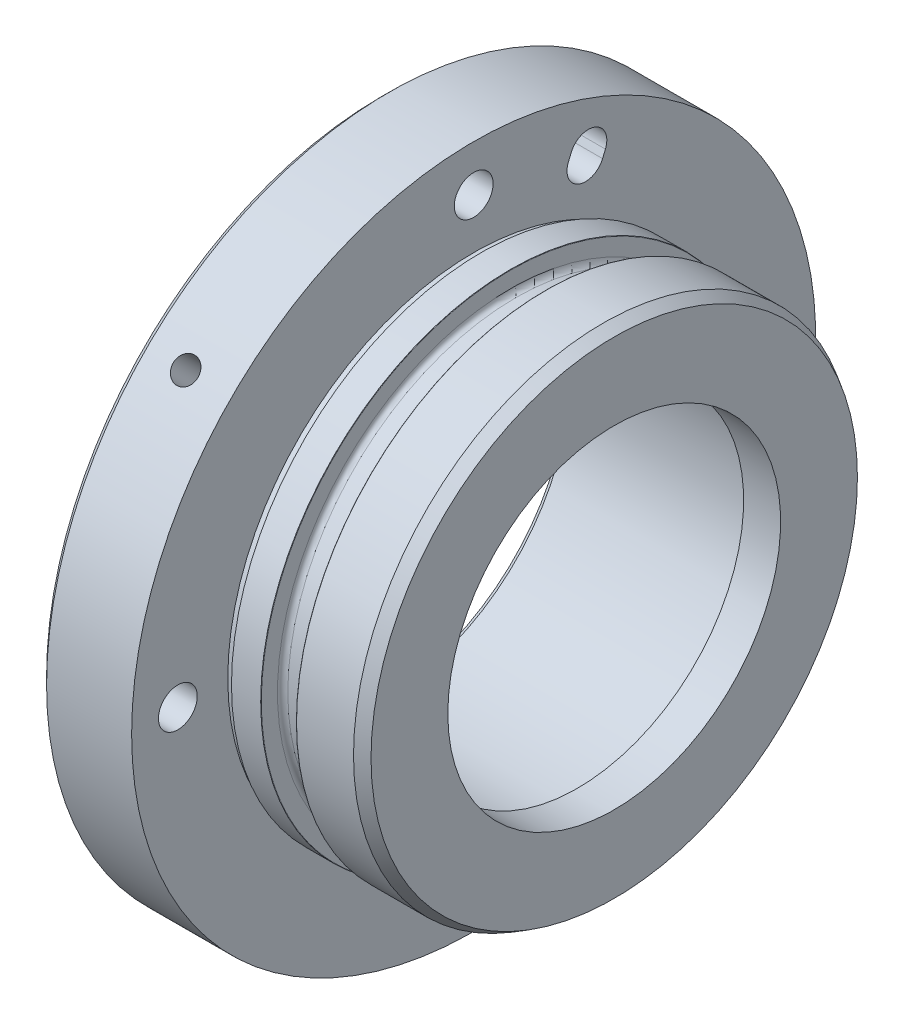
ISO-10303-21;
HEADER;
FILE_DESCRIPTION(('STEP AP214'),'2;1');
FILE_NAME('part.step','',(''),(''),'','','');
FILE_SCHEMA(('AUTOMOTIVE_DESIGN { 1 0 10303 214 1 1 1 1 }'));
ENDSEC;
DATA;
#1=APPLICATION_CONTEXT('core data for automotive mechanical design processes');
#2=APPLICATION_PROTOCOL_DEFINITION('international standard','automotive_design',2000,#1);
#3=PRODUCT_CONTEXT('',#1,'mechanical');
#4=PRODUCT('Part','Part','',(#3));
#5=PRODUCT_RELATED_PRODUCT_CATEGORY('part','',(#4));
#6=PRODUCT_DEFINITION_FORMATION('','',#4);
#7=PRODUCT_DEFINITION_CONTEXT('part definition',#1,'design');
#8=PRODUCT_DEFINITION('design','',#6,#7);
#9=PRODUCT_DEFINITION_SHAPE('','',#8);
#10=(LENGTH_UNIT() NAMED_UNIT(*) SI_UNIT(.MILLI.,.METRE.));
#11=(NAMED_UNIT(*) PLANE_ANGLE_UNIT() SI_UNIT($,.RADIAN.));
#12=(NAMED_UNIT(*) SI_UNIT($,.STERADIAN.) SOLID_ANGLE_UNIT());
#13=UNCERTAINTY_MEASURE_WITH_UNIT(LENGTH_MEASURE(1.E-05),#10,'distance_accuracy_value','');
#14=(GEOMETRIC_REPRESENTATION_CONTEXT(3) GLOBAL_UNCERTAINTY_ASSIGNED_CONTEXT((#13)) GLOBAL_UNIT_ASSIGNED_CONTEXT((#10,
#11,#12)) REPRESENTATION_CONTEXT('',''));
#15=CARTESIAN_POINT('',(0.,0.,0.));
#16=DIRECTION('',(0.,0.,1.));
#17=DIRECTION('',(1.,0.,0.));
#18=AXIS2_PLACEMENT_3D('',#15,#16,#17);
#19=CARTESIAN_POINT('',(-14.2354130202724,0.,0.));
#20=DIRECTION('',(-1.,0.,0.));
#21=DIRECTION('',(0.,0.,1.));
#22=AXIS2_PLACEMENT_3D('',#19,#20,#21);
#23=CYLINDRICAL_SURFACE('',#22,50.);
#24=CARTESIAN_POINT('',(-24.,0.,0.));
#25=DIRECTION('',(1.,0.,0.));
#26=DIRECTION('',(0.,0.,-1.));
#27=AXIS2_PLACEMENT_3D('',#24,#25,#26);
#28=CIRCLE('',#27,50.);
#29=CARTESIAN_POINT('',(-24.,0.,-50.));
#30=VERTEX_POINT('',#29);
#31=EDGE_CURVE('E581',#30,#30,#28,.F.);
#32=ORIENTED_EDGE('',*,*,#31,.T.);
#33=EDGE_LOOP('',(#32));
#34=FACE_BOUND('',#33,.T.);
#35=CARTESIAN_POINT('',(28.,0.,0.));
#36=DIRECTION('',(-1.,0.,0.));
#37=DIRECTION('',(0.,0.,1.));
#38=AXIS2_PLACEMENT_3D('',#35,#36,#37);
#39=CIRCLE('',#38,50.);
#40=CARTESIAN_POINT('',(28.,0.,50.));
#41=VERTEX_POINT('',#40);
#42=EDGE_CURVE('E618',#41,#41,#39,.T.);
#43=ORIENTED_EDGE('',*,*,#42,.F.);
#44=EDGE_LOOP('',(#43));
#45=FACE_BOUND('',#44,.T.);
#46=CARTESIAN_POINT('',(-12.5,32.8882178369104,37.6611886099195));
#47=CARTESIAN_POINT('',(-12.6893433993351,32.8882247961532,37.661183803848));
#48=CARTESIAN_POINT('',(-12.8788185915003,32.9002930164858,37.6506543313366));
#49=CARTESIAN_POINT('',(-13.2525348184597,32.9481979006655,37.6087387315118));
#50=CARTESIAN_POINT('',(-13.4367695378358,32.984062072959,37.5773284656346));
#51=CARTESIAN_POINT('',(-13.7945375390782,33.0783334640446,37.4943699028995));
#52=CARTESIAN_POINT('',(-13.9680765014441,33.1367285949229,37.4428324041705));
#53=CARTESIAN_POINT('',(-14.2995987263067,33.2740955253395,37.3208114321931));
#54=CARTESIAN_POINT('',(-14.4575854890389,33.3530626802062,37.2503322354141));
#55=CARTESIAN_POINT('',(-14.7538365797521,33.5291237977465,37.0919379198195));
#56=CARTESIAN_POINT('',(-14.8920703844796,33.6262452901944,37.0039963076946));
#57=CARTESIAN_POINT('',(-15.1446301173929,33.8354103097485,36.8128379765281));
#58=CARTESIAN_POINT('',(-15.2589550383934,33.9474544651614,36.7096206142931));
#59=CARTESIAN_POINT('',(-15.4605474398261,34.1830403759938,36.4903498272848));
#60=CARTESIAN_POINT('',(-15.5477893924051,34.3065928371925,36.374284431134));
#61=CARTESIAN_POINT('',(-15.6925759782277,34.5612877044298,36.132370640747));
#62=CARTESIAN_POINT('',(-15.7501209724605,34.6924300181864,36.0065223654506));
#63=CARTESIAN_POINT('',(-15.8337947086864,34.9581456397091,35.7485980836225));
#64=CARTESIAN_POINT('',(-15.8599716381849,35.0927133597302,35.6165319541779));
#65=CARTESIAN_POINT('',(-15.8803150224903,35.3615368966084,35.3496474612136));
#66=CARTESIAN_POINT('',(-15.8744818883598,35.4957927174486,35.2148291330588));
#67=CARTESIAN_POINT('',(-15.8310103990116,35.7599760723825,34.946523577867));
#68=CARTESIAN_POINT('',(-15.7934238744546,35.8899103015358,34.8130345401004));
#69=CARTESIAN_POINT('',(-15.6875930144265,36.142148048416,34.5510957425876));
#70=CARTESIAN_POINT('',(-15.6193484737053,36.2644515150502,34.422646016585));
#71=CARTESIAN_POINT('',(-15.4540802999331,36.4983279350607,34.1745691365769));
#72=CARTESIAN_POINT('',(-15.3570332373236,36.609892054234,34.0549492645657));
#73=CARTESIAN_POINT('',(-15.1369318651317,36.8193737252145,33.8283544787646));
#74=CARTESIAN_POINT('',(-15.0138772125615,36.9172910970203,33.7213797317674));
#75=CARTESIAN_POINT('',(-14.7449611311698,37.0972840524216,33.5232681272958));
#76=CARTESIAN_POINT('',(-14.5990547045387,37.1793276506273,33.4321632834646));
#77=CARTESIAN_POINT('',(-14.2887342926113,37.3253885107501,33.2690156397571));
#78=CARTESIAN_POINT('',(-14.1243202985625,37.3894057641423,33.1969728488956));
#79=CARTESIAN_POINT('',(-13.7816224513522,37.4979340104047,33.0743357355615));
#80=CARTESIAN_POINT('',(-13.603337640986,37.5424436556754,33.0237428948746));
#81=CARTESIAN_POINT('',(-13.2379726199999,37.6109297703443,32.9457232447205));
#82=CARTESIAN_POINT('',(-13.0508925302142,37.6349065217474,32.9182961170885));
#83=CARTESIAN_POINT('',(-12.6736424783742,37.6617552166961,32.8875754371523));
#84=CARTESIAN_POINT('',(-12.4834793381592,37.6646686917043,32.8842343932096));
#85=CARTESIAN_POINT('',(-12.1051140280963,37.6494347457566,32.9016746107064));
#86=CARTESIAN_POINT('',(-11.9169118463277,37.631287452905,32.9224557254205));
#87=CARTESIAN_POINT('',(-11.5479894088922,37.5743703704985,32.9873996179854));
#88=CARTESIAN_POINT('',(-11.3672623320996,37.5356198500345,33.0315405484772));
#89=CARTESIAN_POINT('',(-11.0182095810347,37.4383888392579,33.1417019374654));
#90=CARTESIAN_POINT('',(-10.8498840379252,37.3799081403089,33.2077226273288));
#91=CARTESIAN_POINT('',(-10.5301235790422,37.2444527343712,33.3595723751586));
#92=CARTESIAN_POINT('',(-10.3787154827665,37.1674492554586,33.4454322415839));
#93=CARTESIAN_POINT('',(-10.097358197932,36.9968005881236,33.634102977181));
#94=CARTESIAN_POINT('',(-9.96740925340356,36.9031552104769,33.7369140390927));
#95=CARTESIAN_POINT('',(-9.73244593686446,36.7013116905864,33.956382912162));
#96=CARTESIAN_POINT('',(-9.62747233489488,36.5930901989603,34.0730629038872));
#97=CARTESIAN_POINT('',(-9.44571866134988,36.3649158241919,34.3164783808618));
#98=CARTESIAN_POINT('',(-9.36893839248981,36.2449630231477,34.4432137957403));
#99=CARTESIAN_POINT('',(-9.24582162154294,35.9965478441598,34.7027485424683));
#100=CARTESIAN_POINT('',(-9.199459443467,35.8680927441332,34.8355426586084));
#101=CARTESIAN_POINT('',(-9.13841090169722,35.6060540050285,35.1033331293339));
#102=CARTESIAN_POINT('',(-9.12372416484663,35.4724704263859,35.2383294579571));
#103=CARTESIAN_POINT('',(-9.12644715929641,35.2041922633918,35.5063477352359));
#104=CARTESIAN_POINT('',(-9.14379314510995,35.0695004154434,35.6393730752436));
#105=CARTESIAN_POINT('',(-9.20995686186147,34.8026387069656,35.900015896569));
#106=CARTESIAN_POINT('',(-9.25877464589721,34.6704688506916,36.0276333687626));
#107=CARTESIAN_POINT('',(-9.38648137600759,34.4125881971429,36.2740348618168));
#108=CARTESIAN_POINT('',(-9.46536984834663,34.2868772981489,36.3928190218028));
#109=CARTESIAN_POINT('',(-9.65097023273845,34.0457512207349,36.6184943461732));
#110=CARTESIAN_POINT('',(-9.75768148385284,33.9303357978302,36.7253857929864));
#111=CARTESIAN_POINT('',(-9.99613525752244,33.7131956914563,36.9248188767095));
#112=CARTESIAN_POINT('',(-10.1279242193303,33.6114970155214,37.0173333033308));
#113=CARTESIAN_POINT('',(-10.4127232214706,33.4252794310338,37.1855682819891));
#114=CARTESIAN_POINT('',(-10.5657384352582,33.3407647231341,37.26128472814));
#115=CARTESIAN_POINT('',(-10.8888469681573,33.1916110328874,37.3942105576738));
#116=CARTESIAN_POINT('',(-11.0589634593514,33.1269995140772,37.4513943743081));
#117=CARTESIAN_POINT('',(-11.4111551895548,33.0200297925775,37.5457423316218));
#118=CARTESIAN_POINT('',(-11.5932161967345,32.9776456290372,37.5829298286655));
#119=CARTESIAN_POINT('',(-11.8969856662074,32.9275289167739,37.6268317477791));
#120=CARTESIAN_POINT('',(-12.0167325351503,32.9128094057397,37.6397017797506));
#121=CARTESIAN_POINT('',(-12.2576349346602,32.8931516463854,37.6568817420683));
#122=CARTESIAN_POINT('',(-12.3787904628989,32.8882133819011,37.6611916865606));
#123=CARTESIAN_POINT('',(-12.5,32.8882178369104,37.6611886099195));
#124=B_SPLINE_CURVE_WITH_KNOTS('',3,(#46,#47,#48,#49,#50,#51,#52,#53,#54,#55,#56,#57,#58,#59,
#60,#61,#62,#63,#64,#65,#66,#67,#68,#69,#70,#71,#72,#73,#74,#75,#76,#77,#78,#79,#80,#81,#82,#83,
#84,#85,#86,#87,#88,#89,#90,#91,#92,#93,#94,#95,#96,#97,#98,#99,#100,#101,#102,#103,#104,#105,
#106,#107,#108,#109,#110,#111,#112,#113,#114,#115,#116,#117,#118,#119,#120,#121,#122,#123),
.UNSPECIFIED.,.T.,.F.,(4,2,2,2,2,2,2,2,2,2,2,2,2,2,2,2,2,2,2,2,2,2,2,2,2,2,2,2,2,2,2,2,2,2,2,2,
2,2,4),(0.,0.567587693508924,1.13583267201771,1.70377320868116,2.27158562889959,2.8402661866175,
3.40897069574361,3.97820963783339,4.54744166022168,5.11579810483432,5.68414725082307,
6.25157047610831,6.81899750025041,7.38688737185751,7.95478473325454,8.52381474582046,
9.09284502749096,9.66191461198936,10.2309763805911,10.7989157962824,11.3668517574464,
11.9342574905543,12.5016692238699,13.0699680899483,13.6382734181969,14.2075001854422,
14.7767229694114,15.3454646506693,15.9141996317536,16.4818040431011,17.0494094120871,
17.6170058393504,18.1845887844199,18.7532332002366,19.3220164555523,19.8915810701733,
20.460478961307,20.8238249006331,21.1871702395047),.UNSPECIFIED.);
#125=CARTESIAN_POINT('',(-12.5,32.8882178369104,37.6611886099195));
#126=VERTEX_POINT('',#125);
#127=EDGE_CURVE('E552',#126,#126,#124,.T.);
#128=ORIENTED_EDGE('',*,*,#127,.F.);
#129=EDGE_LOOP('',(#128));
#130=FACE_BOUND('',#129,.T.);
#131=ADVANCED_FACE('F458',(#34,#45,#130),#23,.F.);
#132=CARTESIAN_POINT('',(-14.2354130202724,0.,0.));
#133=DIRECTION('',(-1.,0.,0.));
#134=DIRECTION('',(0.,0.,1.));
#135=AXIS2_PLACEMENT_3D('',#132,#133,#134);
#136=CYLINDRICAL_SURFACE('',#135,92.5);
#137=CARTESIAN_POINT('',(-23.,0.,0.));
#138=DIRECTION('',(1.,0.,0.));
#139=DIRECTION('',(0.,0.,-1.));
#140=AXIS2_PLACEMENT_3D('',#137,#138,#139);
#141=CIRCLE('',#140,92.5);
#142=CARTESIAN_POINT('',(-23.,0.,-92.5));
#143=VERTEX_POINT('',#142);
#144=EDGE_CURVE('E582',#143,#143,#141,.T.);
#145=ORIENTED_EDGE('',*,*,#144,.T.);
#146=EDGE_LOOP('',(#145));
#147=FACE_BOUND('',#146,.T.);
#148=CARTESIAN_POINT('',(0.,0.,0.));
#149=DIRECTION('',(-1.,0.,0.));
#150=DIRECTION('',(0.,0.,1.));
#151=AXIS2_PLACEMENT_3D('',#148,#149,#150);
#152=CIRCLE('',#151,92.5);
#153=CARTESIAN_POINT('',(0.,0.,92.5));
#154=VERTEX_POINT('',#153);
#155=EDGE_CURVE('E645',#154,#154,#152,.T.);
#156=ORIENTED_EDGE('',*,*,#155,.T.);
#157=EDGE_LOOP('',(#156));
#158=FACE_BOUND('',#157,.T.);
#159=CARTESIAN_POINT('',(-12.5,62.9773401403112,67.7503109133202));
#160=CARTESIAN_POINT('',(-12.3104924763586,62.9773466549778,67.750305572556));
#161=CARTESIAN_POINT('',(-12.1208491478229,62.9890809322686,67.739403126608));
#162=CARTESIAN_POINT('',(-11.7467900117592,63.0356923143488,67.6960299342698));
#163=CARTESIAN_POINT('',(-11.5623806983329,63.070596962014,67.6635335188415));
#164=CARTESIAN_POINT('',(-11.2042626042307,63.1624489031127,67.5777994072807));
#165=CARTESIAN_POINT('',(-11.0305485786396,63.2193852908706,67.5245719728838));
#166=CARTESIAN_POINT('',(-10.6987108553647,63.3535122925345,67.3987454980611));
#167=CARTESIAN_POINT('',(-10.5405833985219,63.4306980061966,67.3261511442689));
#168=CARTESIAN_POINT('',(-10.2442634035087,63.6029927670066,67.1634075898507));
#169=CARTESIAN_POINT('',(-10.1060812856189,63.6981111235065,67.07324927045));
#170=CARTESIAN_POINT('',(-9.85366263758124,63.9033439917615,66.8777442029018));
#171=CARTESIAN_POINT('',(-9.73942706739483,64.0134591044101,66.7723968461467));
#172=CARTESIAN_POINT('',(-9.5381224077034,64.2453916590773,66.549271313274));
#173=CARTESIAN_POINT('',(-9.45106040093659,64.3672121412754,66.4314899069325));
#174=CARTESIAN_POINT('',(-9.30662000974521,64.6189040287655,66.186690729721));
#175=CARTESIAN_POINT('',(-9.24924147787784,64.7487753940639,66.0596730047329));
#176=CARTESIAN_POINT('',(-9.16582149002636,65.0127004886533,65.7999469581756));
#177=CARTESIAN_POINT('',(-9.13976597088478,65.1467523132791,65.6672412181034));
#178=CARTESIAN_POINT('',(-9.1196882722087,65.4152283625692,65.3997996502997));
#179=CARTESIAN_POINT('',(-9.12566593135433,65.5496525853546,65.2650638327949));
#180=CARTESIAN_POINT('',(-9.16947312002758,65.8150037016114,64.9974675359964));
#181=CARTESIAN_POINT('',(-9.20728748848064,65.9459322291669,64.8646061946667));
#182=CARTESIAN_POINT('',(-9.31367121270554,66.2007255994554,64.6045438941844));
#183=CARTESIAN_POINT('',(-9.3822406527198,66.324590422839,64.4773429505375));
#184=CARTESIAN_POINT('',(-9.54820545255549,66.5619147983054,64.2323176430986));
#185=CARTESIAN_POINT('',(-9.64560774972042,66.6753718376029,64.1144955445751));
#186=CARTESIAN_POINT('',(-9.86646825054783,66.8888178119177,63.8917825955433));
#187=CARTESIAN_POINT('',(-9.98992654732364,66.9888066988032,63.7868917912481));
#188=CARTESIAN_POINT('',(-10.2594803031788,67.1727454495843,63.5931612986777));
#189=CARTESIAN_POINT('',(-10.4055889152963,67.2566859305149,63.5043310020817));
#190=CARTESIAN_POINT('',(-10.7162494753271,67.4062804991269,63.3455230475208));
#191=CARTESIAN_POINT('',(-10.8808014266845,67.4719345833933,63.2755453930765));
#192=CARTESIAN_POINT('',(-11.2236852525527,67.5832742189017,63.1566126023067));
#193=CARTESIAN_POINT('',(-11.4020173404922,67.6289594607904,63.1076577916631));
#194=CARTESIAN_POINT('',(-11.7673957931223,67.6991967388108,63.0323047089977));
#195=CARTESIAN_POINT('',(-11.9544421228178,67.723748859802,63.0059063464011));
#196=CARTESIAN_POINT('',(-12.3318239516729,67.7510898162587,62.9765054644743));
#197=CARTESIAN_POINT('',(-12.5221574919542,67.753891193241,62.9734894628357));
#198=CARTESIAN_POINT('',(-12.9008123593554,67.7376928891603,62.9909128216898));
#199=CARTESIAN_POINT('',(-13.0891336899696,67.7186932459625,63.0113521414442));
#200=CARTESIAN_POINT('',(-13.4583669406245,67.6593818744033,63.0750340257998));
#201=CARTESIAN_POINT('',(-13.6392808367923,67.6190758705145,63.1182704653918));
#202=CARTESIAN_POINT('',(-13.9886244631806,67.518178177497,63.2261895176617));
#203=CARTESIAN_POINT('',(-14.1570541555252,67.4575864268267,63.2908721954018));
#204=CARTESIAN_POINT('',(-14.4767330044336,67.3176323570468,63.4397097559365));
#205=CARTESIAN_POINT('',(-14.6279742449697,67.2382614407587,63.5238735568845));
#206=CARTESIAN_POINT('',(-14.9089034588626,67.0628122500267,63.7090687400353));
#207=CARTESIAN_POINT('',(-15.0385913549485,66.9667339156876,63.8101001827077));
#208=CARTESIAN_POINT('',(-15.2727940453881,66.7603339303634,64.0260110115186));
#209=CARTESIAN_POINT('',(-15.3772969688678,66.6500056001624,64.1408968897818));
#210=CARTESIAN_POINT('',(-15.5580821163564,66.4180774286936,64.3810283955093));
#211=CARTESIAN_POINT('',(-15.6343644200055,66.2964776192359,64.5062739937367));
#212=CARTESIAN_POINT('',(-15.7565221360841,66.0453356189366,64.7633839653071));
#213=CARTESIAN_POINT('',(-15.802405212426,65.9157954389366,64.8952466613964));
#214=CARTESIAN_POINT('',(-15.8624871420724,65.652326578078,65.1617764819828));
#215=CARTESIAN_POINT('',(-15.8766860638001,65.5183979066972,65.2964436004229));
#216=CARTESIAN_POINT('',(-15.8729957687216,65.2500063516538,65.5646447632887));
#217=CARTESIAN_POINT('',(-15.8551252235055,65.1155438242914,65.6981794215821));
#218=CARTESIAN_POINT('',(-15.7878417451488,64.8498632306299,65.9604434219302));
#219=CARTESIAN_POINT('',(-15.7384287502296,64.7186451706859,66.0891727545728));
#220=CARTESIAN_POINT('',(-15.6094661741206,64.4632790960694,66.3382807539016));
#221=CARTESIAN_POINT('',(-15.5299161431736,64.3391311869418,66.4586592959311));
#222=CARTESIAN_POINT('',(-15.3429424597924,64.101587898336,66.687807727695));
#223=CARTESIAN_POINT('',(-15.2355197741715,63.9881921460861,66.7965780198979));
#224=CARTESIAN_POINT('',(-14.9957891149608,63.7755021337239,66.9996791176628));
#225=CARTESIAN_POINT('',(-14.8634693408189,63.6762145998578,67.0940030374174));
#226=CARTESIAN_POINT('',(-14.5776856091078,63.4948046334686,67.2657076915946));
#227=CARTESIAN_POINT('',(-14.4242164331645,63.4126864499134,67.3430842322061));
#228=CARTESIAN_POINT('',(-14.1004140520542,63.2681253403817,67.4789166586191));
#229=CARTESIAN_POINT('',(-13.930068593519,63.2056968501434,67.5373586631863));
#230=CARTESIAN_POINT('',(-13.5775661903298,63.1025985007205,67.6336978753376));
#231=CARTESIAN_POINT('',(-13.3954235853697,63.0619027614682,67.671619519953));
#232=CARTESIAN_POINT('',(-13.0934461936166,63.0143005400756,67.7159398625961));
#233=CARTESIAN_POINT('',(-12.9755704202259,63.0004594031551,67.7288142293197));
#234=CARTESIAN_POINT('',(-12.7384810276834,62.9819771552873,67.7460014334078));
#235=CARTESIAN_POINT('',(-12.6192674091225,62.9773360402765,67.750314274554));
#236=CARTESIAN_POINT('',(-12.5,62.9773401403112,67.7503109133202));
#237=B_SPLINE_CURVE_WITH_KNOTS('',3,(#159,#160,#161,#162,#163,#164,#165,#166,#167,#168,#169,
#170,#171,#172,#173,#174,#175,#176,#177,#178,#179,#180,#181,#182,#183,#184,#185,#186,#187,#188,
#189,#190,#191,#192,#193,#194,#195,#196,#197,#198,#199,#200,#201,#202,#203,#204,#205,#206,#207,
#208,#209,#210,#211,#212,#213,#214,#215,#216,#217,#218,#219,#220,#221,#222,#223,#224,#225,#226,
#227,#228,#229,#230,#231,#232,#233,#234,#235,#236),.UNSPECIFIED.,.T.,.F.,(4,2,2,2,2,2,2,2,2,2,2,
2,2,2,2,2,2,2,2,2,2,2,2,2,2,2,2,2,2,2,2,2,2,2,2,2,2,2,4),(0.,0.568087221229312,1.13685094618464,
1.70533349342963,2.27367859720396,2.84231956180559,3.41098331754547,3.97979517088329,
4.54860419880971,5.11715775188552,5.68570844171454,6.25398853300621,6.82227018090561,
7.39068867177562,7.9591091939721,8.52786104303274,9.0966129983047,9.66537376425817,
10.2341322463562,10.8025627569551,11.3709922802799,11.9392691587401,12.5075477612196,
13.0760870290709,13.6446283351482,14.2134370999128,14.7822442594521,15.3509079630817,
15.9195704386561,16.4879019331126,17.0562345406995,17.6245756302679,18.1928970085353,
18.7614884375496,19.3302204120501,19.8993683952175,20.4678370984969,20.8253654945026,
21.1828937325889),.UNSPECIFIED.);
#238=CARTESIAN_POINT('',(-12.5,62.9773401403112,67.7503109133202));
#239=VERTEX_POINT('',#238);
#240=EDGE_CURVE('E574',#239,#239,#237,.T.);
#241=ORIENTED_EDGE('',*,*,#240,.F.);
#242=EDGE_LOOP('',(#241));
#243=FACE_BOUND('',#242,.T.);
#244=ADVANCED_FACE('F586',(#147,#158,#243),#136,.T.);
#245=CARTESIAN_POINT('',(-14.2354130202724,0.,0.));
#246=DIRECTION('',(-1.,0.,0.));
#247=DIRECTION('',(0.,0.,1.));
#248=AXIS2_PLACEMENT_3D('',#245,#246,#247);
#249=CYLINDRICAL_SURFACE('',#248,67.5);
#250=CARTESIAN_POINT('',(19.6,0.,0.));
#251=DIRECTION('',(-1.,0.,0.));
#252=DIRECTION('',(0.,0.,1.));
#253=AXIS2_PLACEMENT_3D('',#250,#251,#252);
#254=CIRCLE('',#253,67.5);
#255=CARTESIAN_POINT('',(19.6,0.,67.5));
#256=VERTEX_POINT('',#255);
#257=EDGE_CURVE('E1011',#256,#256,#254,.F.);
#258=ORIENTED_EDGE('',*,*,#257,.T.);
#259=EDGE_LOOP('',(#258));
#260=FACE_BOUND('',#259,.T.);
#261=CARTESIAN_POINT('',(35.,0.,0.));
#262=DIRECTION('',(-1.,0.,0.));
#263=DIRECTION('',(0.,0.,1.));
#264=AXIS2_PLACEMENT_3D('',#261,#262,#263);
#265=CIRCLE('',#264,67.5);
#266=CARTESIAN_POINT('',(35.,0.,67.5));
#267=VERTEX_POINT('',#266);
#268=EDGE_CURVE('E648',#267,#267,#265,.T.);
#269=ORIENTED_EDGE('',*,*,#268,.T.);
#270=EDGE_LOOP('',(#269));
#271=FACE_BOUND('',#270,.T.);
#272=ADVANCED_FACE('F590',(#260,#271),#249,.T.);
#273=CARTESIAN_POINT('',(9.9,0.,0.));
#274=DIRECTION('',(1.,0.,0.));
#275=DIRECTION('',(0.,0.,-1.));
#276=AXIS2_PLACEMENT_3D('',#273,#274,#275);
#277=CIRCLE('',#276,67.5);
#278=CARTESIAN_POINT('',(9.9,0.,-67.5));
#279=VERTEX_POINT('',#278);
#280=EDGE_CURVE('E1008',#279,#279,#277,.F.);
#281=ORIENTED_EDGE('',*,*,#280,.T.);
#282=EDGE_LOOP('',(#281));
#283=FACE_BOUND('',#282,.T.);
#284=CARTESIAN_POINT('',(2.,0.,0.));
#285=DIRECTION('',(-1.,0.,0.));
#286=DIRECTION('',(0.,0.,1.));
#287=AXIS2_PLACEMENT_3D('',#284,#285,#286);
#288=CIRCLE('',#287,67.5);
#289=CARTESIAN_POINT('',(2.,0.,67.5));
#290=VERTEX_POINT('',#289);
#291=EDGE_CURVE('E636',#290,#290,#288,.T.);
#292=ORIENTED_EDGE('',*,*,#291,.F.);
#293=EDGE_LOOP('',(#292));
#294=FACE_BOUND('',#293,.T.);
#295=ADVANCED_FACE('F595',(#283,#294),#249,.T.);
#296=CARTESIAN_POINT('',(-25.,92.5,0.));
#297=DIRECTION('',(1.,0.,0.));
#298=DIRECTION('',(0.,0.,-1.));
#299=AXIS2_PLACEMENT_3D('',#296,#297,#298);
#300=PLANE('',#299);
#301=CARTESIAN_POINT('',(-25.,0.,0.));
#302=DIRECTION('',(1.,0.,0.));
#303=DIRECTION('',(0.,0.,-1.));
#304=AXIS2_PLACEMENT_3D('',#301,#302,#303);
#305=CIRCLE('',#304,50.5773502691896);
#306=CARTESIAN_POINT('',(-25.,0.,-50.5773502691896));
#307=VERTEX_POINT('',#306);
#308=EDGE_CURVE('E1016',#307,#307,#305,.T.);
#309=ORIENTED_EDGE('',*,*,#308,.T.);
#310=EDGE_LOOP('',(#309));
#311=FACE_BOUND('',#310,.T.);
#312=CARTESIAN_POINT('',(-25.,28.7500000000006,-49.7964607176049));
#313=DIRECTION('',(-1.,0.,0.));
#314=DIRECTION('',(0.,0.,1.));
#315=AXIS2_PLACEMENT_3D('',#312,#313,#314);
#316=CIRCLE('',#315,3.4);
#317=CARTESIAN_POINT('',(-25.,28.7500000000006,-46.3964607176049));
#318=VERTEX_POINT('',#317);
#319=EDGE_CURVE('E1045',#318,#318,#316,.T.);
#320=ORIENTED_EDGE('',*,*,#319,.F.);
#321=EDGE_LOOP('',(#320));
#322=FACE_BOUND('',#321,.T.);
#323=CARTESIAN_POINT('',(-25.,-28.7499999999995,-49.7964607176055));
#324=DIRECTION('',(-1.,0.,0.));
#325=DIRECTION('',(0.,0.,1.));
#326=AXIS2_PLACEMENT_3D('',#323,#324,#325);
#327=CIRCLE('',#326,3.4);
#328=CARTESIAN_POINT('',(-25.,-28.7499999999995,-46.3964607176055));
#329=VERTEX_POINT('',#328);
#330=EDGE_CURVE('E1051',#329,#329,#327,.T.);
#331=ORIENTED_EDGE('',*,*,#330,.F.);
#332=EDGE_LOOP('',(#331));
#333=FACE_BOUND('',#332,.T.);
#334=CARTESIAN_POINT('',(-25.,-57.5,-4.01520586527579E-13));
#335=DIRECTION('',(-1.,0.,0.));
#336=DIRECTION('',(0.,0.,1.));
#337=AXIS2_PLACEMENT_3D('',#334,#335,#336);
#338=CIRCLE('',#337,3.39999999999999);
#339=CARTESIAN_POINT('',(-25.,-57.5,3.39999999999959));
#340=VERTEX_POINT('',#339);
#341=EDGE_CURVE('E1059',#340,#340,#338,.T.);
#342=ORIENTED_EDGE('',*,*,#341,.F.);
#343=EDGE_LOOP('',(#342));
#344=FACE_BOUND('',#343,.T.);
#345=CARTESIAN_POINT('',(-25.,-28.7500000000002,49.7964607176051));
#346=DIRECTION('',(-1.,0.,0.));
#347=DIRECTION('',(0.,0.,1.));
#348=AXIS2_PLACEMENT_3D('',#345,#346,#347);
#349=CIRCLE('',#348,3.4);
#350=CARTESIAN_POINT('',(-25.,-28.7500000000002,53.1964607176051));
#351=VERTEX_POINT('',#350);
#352=EDGE_CURVE('E1065',#351,#351,#349,.T.);
#353=ORIENTED_EDGE('',*,*,#352,.F.);
#354=EDGE_LOOP('',(#353));
#355=FACE_BOUND('',#354,.T.);
#356=CARTESIAN_POINT('',(-25.,28.7499999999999,49.7964607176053));
#357=DIRECTION('',(-1.,0.,0.));
#358=DIRECTION('',(0.,0.,1.));
#359=AXIS2_PLACEMENT_3D('',#356,#357,#358);
#360=CIRCLE('',#359,3.4);
#361=CARTESIAN_POINT('',(-25.,28.7499999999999,53.1964607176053));
#362=VERTEX_POINT('',#361);
#363=EDGE_CURVE('E1070',#362,#362,#360,.T.);
#364=ORIENTED_EDGE('',*,*,#363,.F.);
#365=EDGE_LOOP('',(#364));
#366=FACE_BOUND('',#365,.T.);
#367=CARTESIAN_POINT('',(-25.,8.37956006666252E-13,-80.));
#368=DIRECTION('',(-1.,0.,0.));
#369=DIRECTION('',(0.,0.,1.));
#370=AXIS2_PLACEMENT_3D('',#367,#368,#369);
#371=CIRCLE('',#370,5.24999999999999);
#372=CARTESIAN_POINT('',(-25.,8.37956006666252E-13,-74.75));
#373=VERTEX_POINT('',#372);
#374=EDGE_CURVE('E675',#373,#373,#371,.T.);
#375=ORIENTED_EDGE('',*,*,#374,.F.);
#376=EDGE_LOOP('',(#375));
#377=FACE_BOUND('',#376,.T.);
#378=CARTESIAN_POINT('',(-25.,-80.,-5.58637337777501E-13));
#379=DIRECTION('',(-1.,0.,0.));
#380=DIRECTION('',(0.,0.,1.));
#381=AXIS2_PLACEMENT_3D('',#378,#379,#380);
#382=CIRCLE('',#381,5.24999999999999);
#383=CARTESIAN_POINT('',(-25.,-80.,5.24999999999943));
#384=VERTEX_POINT('',#383);
#385=EDGE_CURVE('E665',#384,#384,#382,.T.);
#386=ORIENTED_EDGE('',*,*,#385,.F.);
#387=EDGE_LOOP('',(#386));
#388=FACE_BOUND('',#387,.T.);
#389=CARTESIAN_POINT('',(-25.,-2.79318668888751E-13,80.));
#390=DIRECTION('',(-1.,0.,0.));
#391=DIRECTION('',(0.,0.,1.));
#392=AXIS2_PLACEMENT_3D('',#389,#390,#391);
#393=CIRCLE('',#392,5.24999999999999);
#394=CARTESIAN_POINT('',(-25.,-2.79318668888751E-13,85.25));
#395=VERTEX_POINT('',#394);
#396=EDGE_CURVE('E662',#395,#395,#393,.T.);
#397=ORIENTED_EDGE('',*,*,#396,.F.);
#398=EDGE_LOOP('',(#397));
#399=FACE_BOUND('',#398,.T.);
#400=CARTESIAN_POINT('',(-25.,57.5,0.));
#401=DIRECTION('',(-1.,0.,0.));
#402=DIRECTION('',(0.,0.,1.));
#403=AXIS2_PLACEMENT_3D('',#400,#401,#402);
#404=CIRCLE('',#403,3.39999999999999);
#405=CARTESIAN_POINT('',(-25.,57.5,3.39999999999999));
#406=VERTEX_POINT('',#405);
#407=EDGE_CURVE('E680',#406,#406,#404,.T.);
#408=ORIENTED_EDGE('',*,*,#407,.F.);
#409=EDGE_LOOP('',(#408));
#410=FACE_BOUND('',#409,.T.);
#411=CARTESIAN_POINT('',(-25.,80.,0.));
#412=DIRECTION('',(-1.,0.,0.));
#413=DIRECTION('',(0.,0.,1.));
#414=AXIS2_PLACEMENT_3D('',#411,#412,#413);
#415=CIRCLE('',#414,5.24999999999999);
#416=CARTESIAN_POINT('',(-25.,80.,5.24999999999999));
#417=VERTEX_POINT('',#416);
#418=EDGE_CURVE('E629',#417,#417,#415,.T.);
#419=ORIENTED_EDGE('',*,*,#418,.F.);
#420=EDGE_LOOP('',(#419));
#421=FACE_BOUND('',#420,.T.);
#422=CARTESIAN_POINT('',(-25.,0.,0.));
#423=DIRECTION('',(1.,0.,0.));
#424=DIRECTION('',(0.,0.,-1.));
#425=AXIS2_PLACEMENT_3D('',#422,#423,#424);
#426=CIRCLE('',#425,90.5);
#427=CARTESIAN_POINT('',(-25.,0.,-90.5));
#428=VERTEX_POINT('',#427);
#429=EDGE_CURVE('E654',#428,#428,#426,.F.);
#430=ORIENTED_EDGE('',*,*,#429,.T.);
#431=EDGE_LOOP('',(#430));
#432=FACE_BOUND('',#431,.T.);
#433=ADVANCED_FACE('F593',(#311,#322,#333,#344,#355,#366,#377,#388,#399,#410,#421,#432),#300,.F.);
#434=CARTESIAN_POINT('',(0.,66.5,0.));
#435=DIRECTION('',(-1.,0.,0.));
#436=DIRECTION('',(0.,0.,1.));
#437=AXIS2_PLACEMENT_3D('',#434,#435,#436);
#438=PLANE('',#437);
#439=DIRECTION('',(0.,0.923879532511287,-0.38268343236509));
#440=VECTOR('',#439,1.);
#441=CARTESIAN_POINT('',(0.,71.0730659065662,-34.8513888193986));
#442=LINE('',#441,#440);
#443=CARTESIAN_POINT('',(0.,71.0730659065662,-34.8513888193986));
#444=VERTEX_POINT('',#443);
#445=CARTESIAN_POINT('',(0.,72.9208249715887,-35.6167556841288));
#446=VERTEX_POINT('',#445);
#447=EDGE_CURVE('E529',#444,#446,#442,.T.);
#448=ORIENTED_EDGE('',*,*,#447,.F.);
#449=CARTESIAN_POINT('',(0.,72.9864830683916,-30.2319911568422));
#450=DIRECTION('',(1.,0.,0.));
#451=DIRECTION('',(0.,0.,-1.));
#452=AXIS2_PLACEMENT_3D('',#449,#450,#451);
#453=CIRCLE('',#452,5.00000000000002);
#454=CARTESIAN_POINT('',(0.,74.8999002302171,-25.6125934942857));
#455=VERTEX_POINT('',#454);
#456=EDGE_CURVE('E473',#455,#444,#453,.T.);
#457=ORIENTED_EDGE('',*,*,#456,.F.);
#458=DIRECTION('',(0.,-0.923879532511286,0.382683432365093));
#459=VECTOR('',#458,1.);
#460=CARTESIAN_POINT('',(0.,74.8999002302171,-25.6125934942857));
#461=LINE('',#460,#459);
#462=CARTESIAN_POINT('',(0.,76.7476592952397,-26.3779603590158));
#463=VERTEX_POINT('',#462);
#464=EDGE_CURVE('E536',#463,#455,#461,.T.);
#465=ORIENTED_EDGE('',*,*,#464,.F.);
#466=CARTESIAN_POINT('',(0.,74.8342421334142,-30.9973580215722));
#467=DIRECTION('',(1.,0.,0.));
#468=DIRECTION('',(0.,0.,1.));
#469=AXIS2_PLACEMENT_3D('',#466,#467,#468);
#470=CIRCLE('',#469,5.00000000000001);
#471=EDGE_CURVE('E518',#446,#463,#470,.T.);
#472=ORIENTED_EDGE('',*,*,#471,.F.);
#473=EDGE_LOOP('',(#448,#457,#465,#472));
#474=FACE_BOUND('',#473,.T.);
#475=CARTESIAN_POINT('',(0.,8.37956006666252E-13,-80.));
#476=DIRECTION('',(-1.,0.,0.));
#477=DIRECTION('',(0.,0.,1.));
#478=AXIS2_PLACEMENT_3D('',#475,#476,#477);
#479=CIRCLE('',#478,5.24999999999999);
#480=CARTESIAN_POINT('',(0.,8.37956006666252E-13,-74.75));
#481=VERTEX_POINT('',#480);
#482=EDGE_CURVE('E583',#481,#481,#479,.T.);
#483=ORIENTED_EDGE('',*,*,#482,.T.);
#484=EDGE_LOOP('',(#483));
#485=FACE_BOUND('',#484,.T.);
#486=CARTESIAN_POINT('',(0.,-80.,-5.58637337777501E-13));
#487=DIRECTION('',(-1.,0.,0.));
#488=DIRECTION('',(0.,0.,1.));
#489=AXIS2_PLACEMENT_3D('',#486,#487,#488);
#490=CIRCLE('',#489,5.24999999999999);
#491=CARTESIAN_POINT('',(0.,-80.,5.24999999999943));
#492=VERTEX_POINT('',#491);
#493=EDGE_CURVE('E663',#492,#492,#490,.T.);
#494=ORIENTED_EDGE('',*,*,#493,.T.);
#495=EDGE_LOOP('',(#494));
#496=FACE_BOUND('',#495,.T.);
#497=CARTESIAN_POINT('',(0.,-2.79318668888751E-13,80.));
#498=DIRECTION('',(-1.,0.,0.));
#499=DIRECTION('',(0.,0.,1.));
#500=AXIS2_PLACEMENT_3D('',#497,#498,#499);
#501=CIRCLE('',#500,5.24999999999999);
#502=CARTESIAN_POINT('',(0.,-2.79318668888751E-13,85.25));
#503=VERTEX_POINT('',#502);
#504=EDGE_CURVE('E659',#503,#503,#501,.T.);
#505=ORIENTED_EDGE('',*,*,#504,.T.);
#506=EDGE_LOOP('',(#505));
#507=FACE_BOUND('',#506,.T.);
#508=CARTESIAN_POINT('',(0.,80.,0.));
#509=DIRECTION('',(-1.,0.,0.));
#510=DIRECTION('',(0.,0.,1.));
#511=AXIS2_PLACEMENT_3D('',#508,#509,#510);
#512=CIRCLE('',#511,5.24999999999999);
#513=CARTESIAN_POINT('',(0.,80.,5.24999999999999));
#514=VERTEX_POINT('',#513);
#515=EDGE_CURVE('E623',#514,#514,#512,.T.);
#516=ORIENTED_EDGE('',*,*,#515,.T.);
#517=EDGE_LOOP('',(#516));
#518=FACE_BOUND('',#517,.T.);
#519=ORIENTED_EDGE('',*,*,#155,.F.);
#520=EDGE_LOOP('',(#519));
#521=FACE_BOUND('',#520,.T.);
#522=CARTESIAN_POINT('',(0.,0.,0.));
#523=DIRECTION('',(-1.,0.,0.));
#524=DIRECTION('',(0.,0.,1.));
#525=AXIS2_PLACEMENT_3D('',#522,#523,#524);
#526=CIRCLE('',#525,66.5);
#527=CARTESIAN_POINT('',(0.,0.,66.5));
#528=VERTEX_POINT('',#527);
#529=EDGE_CURVE('E642',#528,#528,#526,.T.);
#530=ORIENTED_EDGE('',*,*,#529,.T.);
#531=EDGE_LOOP('',(#530));
#532=FACE_BOUND('',#531,.T.);
#533=ADVANCED_FACE('F533',(#474,#485,#496,#507,#518,#521,#532),#438,.F.);
#534=CARTESIAN_POINT('',(-14.2354130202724,0.,0.));
#535=DIRECTION('',(-1.,0.,0.));
#536=DIRECTION('',(0.,0.,1.));
#537=AXIS2_PLACEMENT_3D('',#534,#535,#536);
#538=CYLINDRICAL_SURFACE('',#537,66.5);
#539=ORIENTED_EDGE('',*,*,#529,.F.);
#540=EDGE_LOOP('',(#539));
#541=FACE_BOUND('',#540,.T.);
#542=CARTESIAN_POINT('',(2.,0.,0.));
#543=DIRECTION('',(-1.,0.,0.));
#544=DIRECTION('',(0.,0.,1.));
#545=AXIS2_PLACEMENT_3D('',#542,#543,#544);
#546=CIRCLE('',#545,66.5);
#547=CARTESIAN_POINT('',(2.,0.,66.5));
#548=VERTEX_POINT('',#547);
#549=EDGE_CURVE('E639',#548,#548,#546,.T.);
#550=ORIENTED_EDGE('',*,*,#549,.T.);
#551=EDGE_LOOP('',(#550));
#552=FACE_BOUND('',#551,.T.);
#553=ADVANCED_FACE('F602',(#541,#552),#538,.T.);
#554=CARTESIAN_POINT('',(2.,67.5,0.));
#555=DIRECTION('',(1.,0.,0.));
#556=DIRECTION('',(0.,0.,-1.));
#557=AXIS2_PLACEMENT_3D('',#554,#555,#556);
#558=PLANE('',#557);
#559=ORIENTED_EDGE('',*,*,#549,.F.);
#560=EDGE_LOOP('',(#559));
#561=FACE_BOUND('',#560,.T.);
#562=ORIENTED_EDGE('',*,*,#291,.T.);
#563=EDGE_LOOP('',(#562));
#564=FACE_BOUND('',#563,.T.);
#565=ADVANCED_FACE('F719',(#561,#564),#558,.F.);
#566=CARTESIAN_POINT('',(38.,45.,0.));
#567=DIRECTION('',(-1.,0.,0.));
#568=DIRECTION('',(0.,0.,1.));
#569=AXIS2_PLACEMENT_3D('',#566,#567,#568);
#570=PLANE('',#569);
#571=CARTESIAN_POINT('',(38.,0.,0.));
#572=DIRECTION('',(-1.,0.,0.));
#573=DIRECTION('',(0.,0.,1.));
#574=AXIS2_PLACEMENT_3D('',#571,#572,#573);
#575=CIRCLE('',#574,65.7679491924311);
#576=CARTESIAN_POINT('',(38.,0.,65.7679491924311));
#577=VERTEX_POINT('',#576);
#578=EDGE_CURVE('E651',#577,#577,#575,.F.);
#579=ORIENTED_EDGE('',*,*,#578,.T.);
#580=EDGE_LOOP('',(#579));
#581=FACE_BOUND('',#580,.T.);
#582=CARTESIAN_POINT('',(38.,0.,0.));
#583=DIRECTION('',(-1.,0.,0.));
#584=DIRECTION('',(0.,0.,1.));
#585=AXIS2_PLACEMENT_3D('',#582,#583,#584);
#586=CIRCLE('',#585,45.);
#587=CARTESIAN_POINT('',(38.,0.,45.));
#588=VERTEX_POINT('',#587);
#589=EDGE_CURVE('E626',#588,#588,#586,.T.);
#590=ORIENTED_EDGE('',*,*,#589,.T.);
#591=EDGE_LOOP('',(#590));
#592=FACE_BOUND('',#591,.T.);
#593=ADVANCED_FACE('F716',(#581,#592),#570,.F.);
#594=CARTESIAN_POINT('',(-14.2354130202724,0.,0.));
#595=DIRECTION('',(-1.,0.,0.));
#596=DIRECTION('',(0.,0.,1.));
#597=AXIS2_PLACEMENT_3D('',#594,#595,#596);
#598=CYLINDRICAL_SURFACE('',#597,45.);
#599=ORIENTED_EDGE('',*,*,#589,.F.);
#600=EDGE_LOOP('',(#599));
#601=FACE_BOUND('',#600,.T.);
#602=CARTESIAN_POINT('',(28.,0.,0.));
#603=DIRECTION('',(-1.,0.,0.));
#604=DIRECTION('',(0.,0.,1.));
#605=AXIS2_PLACEMENT_3D('',#602,#603,#604);
#606=CIRCLE('',#605,45.);
#607=CARTESIAN_POINT('',(28.,0.,45.));
#608=VERTEX_POINT('',#607);
#609=EDGE_CURVE('E622',#608,#608,#606,.T.);
#610=ORIENTED_EDGE('',*,*,#609,.T.);
#611=EDGE_LOOP('',(#610));
#612=FACE_BOUND('',#611,.T.);
#613=ADVANCED_FACE('F712',(#601,#612),#598,.F.);
#614=CARTESIAN_POINT('',(28.,50.,0.));
#615=DIRECTION('',(1.,0.,0.));
#616=DIRECTION('',(0.,0.,-1.));
#617=AXIS2_PLACEMENT_3D('',#614,#615,#616);
#618=PLANE('',#617);
#619=ORIENTED_EDGE('',*,*,#609,.F.);
#620=EDGE_LOOP('',(#619));
#621=FACE_BOUND('',#620,.T.);
#622=ORIENTED_EDGE('',*,*,#42,.T.);
#623=EDGE_LOOP('',(#622));
#624=FACE_BOUND('',#623,.T.);
#625=ADVANCED_FACE('F704',(#621,#624),#618,.F.);
#626=CARTESIAN_POINT('',(35.,0.,0.));
#627=DIRECTION('',(-1.,0.,0.));
#628=DIRECTION('',(0.,0.,1.));
#629=AXIS2_PLACEMENT_3D('',#626,#627,#628);
#630=CONICAL_SURFACE('',#629,67.5,0.523598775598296);
#631=ORIENTED_EDGE('',*,*,#578,.F.);
#632=EDGE_LOOP('',(#631));
#633=FACE_BOUND('',#632,.T.);
#634=ORIENTED_EDGE('',*,*,#268,.F.);
#635=EDGE_LOOP('',(#634));
#636=FACE_BOUND('',#635,.T.);
#637=ADVANCED_FACE('F695',(#633,#636),#630,.T.);
#638=CARTESIAN_POINT('',(-25.,0.,0.));
#639=DIRECTION('',(1.,0.,0.));
#640=DIRECTION('',(0.,0.,-1.));
#641=AXIS2_PLACEMENT_3D('',#638,#639,#640);
#642=CONICAL_SURFACE('',#641,90.5,0.785398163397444);
#643=ORIENTED_EDGE('',*,*,#144,.F.);
#644=EDGE_LOOP('',(#643));
#645=FACE_BOUND('',#644,.T.);
#646=ORIENTED_EDGE('',*,*,#429,.F.);
#647=EDGE_LOOP('',(#646));
#648=FACE_BOUND('',#647,.T.);
#649=ADVANCED_FACE('F693',(#645,#648),#642,.T.);
#650=CARTESIAN_POINT('',(-25.,80.,0.));
#651=DIRECTION('',(-1.,0.,0.));
#652=DIRECTION('',(0.,0.,1.));
#653=AXIS2_PLACEMENT_3D('',#650,#651,#652);
#654=CYLINDRICAL_SURFACE('',#653,5.24999999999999);
#655=ORIENTED_EDGE('',*,*,#418,.T.);
#656=EDGE_LOOP('',(#655));
#657=FACE_BOUND('',#656,.T.);
#658=ORIENTED_EDGE('',*,*,#515,.F.);
#659=EDGE_LOOP('',(#658));
#660=FACE_BOUND('',#659,.T.);
#661=ADVANCED_FACE('F687',(#657,#660),#654,.F.);
#662=CARTESIAN_POINT('',(-25.,57.5,0.));
#663=DIRECTION('',(-1.,0.,0.));
#664=DIRECTION('',(0.,0.,1.));
#665=AXIS2_PLACEMENT_3D('',#662,#663,#664);
#666=CYLINDRICAL_SURFACE('',#665,3.39999999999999);
#667=CARTESIAN_POINT('',(6.25,57.5,0.));
#668=DIRECTION('',(-1.,0.,0.));
#669=DIRECTION('',(0.,0.,1.));
#670=AXIS2_PLACEMENT_3D('',#667,#668,#669);
#671=CIRCLE('',#670,3.39999999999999);
#672=CARTESIAN_POINT('',(6.25,57.5,3.39999999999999));
#673=VERTEX_POINT('',#672);
#674=EDGE_CURVE('E661',#673,#673,#671,.T.);
#675=ORIENTED_EDGE('',*,*,#674,.F.);
#676=EDGE_LOOP('',(#675));
#677=FACE_BOUND('',#676,.T.);
#678=ORIENTED_EDGE('',*,*,#407,.T.);
#679=EDGE_LOOP('',(#678));
#680=FACE_BOUND('',#679,.T.);
#681=ADVANCED_FACE('F702',(#677,#680),#666,.F.);
#682=CARTESIAN_POINT('',(6.25,57.5,0.));
#683=DIRECTION('',(-1.,0.,0.));
#684=DIRECTION('',(0.,0.,1.));
#685=AXIS2_PLACEMENT_3D('',#682,#683,#684);
#686=CONICAL_SURFACE('',#685,3.39999999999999,1.02974425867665);
#687=CARTESIAN_POINT('',(8.29292610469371,57.5,0.));
#688=VERTEX_POINT('',#687);
#689=VERTEX_LOOP('',#688);
#690=FACE_BOUND('',#689,.T.);
#691=ORIENTED_EDGE('',*,*,#674,.T.);
#692=EDGE_LOOP('',(#691));
#693=FACE_BOUND('',#692,.T.);
#694=ADVANCED_FACE('F772',(#690,#693),#686,.F.);
#695=CARTESIAN_POINT('',(-25.,-2.79318668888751E-13,80.));
#696=DIRECTION('',(-1.,0.,0.));
#697=DIRECTION('',(0.,0.,1.));
#698=AXIS2_PLACEMENT_3D('',#695,#696,#697);
#699=CYLINDRICAL_SURFACE('',#698,5.24999999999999);
#700=ORIENTED_EDGE('',*,*,#396,.T.);
#701=EDGE_LOOP('',(#700));
#702=FACE_BOUND('',#701,.T.);
#703=ORIENTED_EDGE('',*,*,#504,.F.);
#704=EDGE_LOOP('',(#703));
#705=FACE_BOUND('',#704,.T.);
#706=ADVANCED_FACE('F779',(#702,#705),#699,.F.);
#707=CARTESIAN_POINT('',(-25.,-80.,-5.58637337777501E-13));
#708=DIRECTION('',(-1.,0.,0.));
#709=DIRECTION('',(0.,0.,1.));
#710=AXIS2_PLACEMENT_3D('',#707,#708,#709);
#711=CYLINDRICAL_SURFACE('',#710,5.24999999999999);
#712=ORIENTED_EDGE('',*,*,#385,.T.);
#713=EDGE_LOOP('',(#712));
#714=FACE_BOUND('',#713,.T.);
#715=ORIENTED_EDGE('',*,*,#493,.F.);
#716=EDGE_LOOP('',(#715));
#717=FACE_BOUND('',#716,.T.);
#718=ADVANCED_FACE('F786',(#714,#717),#711,.F.);
#719=CARTESIAN_POINT('',(-25.,8.37956006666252E-13,-80.));
#720=DIRECTION('',(-1.,0.,0.));
#721=DIRECTION('',(0.,0.,1.));
#722=AXIS2_PLACEMENT_3D('',#719,#720,#721);
#723=CYLINDRICAL_SURFACE('',#722,5.24999999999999);
#724=ORIENTED_EDGE('',*,*,#374,.T.);
#725=EDGE_LOOP('',(#724));
#726=FACE_BOUND('',#725,.T.);
#727=ORIENTED_EDGE('',*,*,#482,.F.);
#728=EDGE_LOOP('',(#727));
#729=FACE_BOUND('',#728,.T.);
#730=ADVANCED_FACE('F794',(#726,#729),#723,.F.);
#731=CARTESIAN_POINT('',(-25.,28.7499999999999,49.7964607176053));
#732=DIRECTION('',(-1.,0.,0.));
#733=DIRECTION('',(0.,0.,1.));
#734=AXIS2_PLACEMENT_3D('',#731,#732,#733);
#735=CYLINDRICAL_SURFACE('',#734,3.4);
#736=CARTESIAN_POINT('',(6.25,28.7499999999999,49.7964607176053));
#737=DIRECTION('',(-1.,0.,0.));
#738=DIRECTION('',(0.,0.,1.));
#739=AXIS2_PLACEMENT_3D('',#736,#737,#738);
#740=CIRCLE('',#739,3.39999999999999);
#741=CARTESIAN_POINT('',(6.25,28.7499999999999,53.1964607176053));
#742=VERTEX_POINT('',#741);
#743=EDGE_CURVE('E1068',#742,#742,#740,.T.);
#744=ORIENTED_EDGE('',*,*,#743,.F.);
#745=EDGE_LOOP('',(#744));
#746=FACE_BOUND('',#745,.T.);
#747=ORIENTED_EDGE('',*,*,#363,.T.);
#748=EDGE_LOOP('',(#747));
#749=FACE_BOUND('',#748,.T.);
#750=ADVANCED_FACE('F801',(#746,#749),#735,.F.);
#751=CARTESIAN_POINT('',(6.25,28.7499999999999,49.7964607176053));
#752=DIRECTION('',(-1.,0.,0.));
#753=DIRECTION('',(0.,0.,1.));
#754=AXIS2_PLACEMENT_3D('',#751,#752,#753);
#755=CONICAL_SURFACE('',#754,3.39999999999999,1.02974425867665);
#756=CARTESIAN_POINT('',(8.29292610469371,28.7499999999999,49.7964607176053));
#757=VERTEX_POINT('',#756);
#758=VERTEX_LOOP('',#757);
#759=FACE_BOUND('',#758,.T.);
#760=ORIENTED_EDGE('',*,*,#743,.T.);
#761=EDGE_LOOP('',(#760));
#762=FACE_BOUND('',#761,.T.);
#763=ADVANCED_FACE('F809',(#759,#762),#755,.F.);
#764=CARTESIAN_POINT('',(-25.,-28.7500000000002,49.7964607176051));
#765=DIRECTION('',(-1.,0.,0.));
#766=DIRECTION('',(0.,0.,1.));
#767=AXIS2_PLACEMENT_3D('',#764,#765,#766);
#768=CYLINDRICAL_SURFACE('',#767,3.4);
#769=CARTESIAN_POINT('',(6.25,-28.7500000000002,49.7964607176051));
#770=DIRECTION('',(-1.,0.,0.));
#771=DIRECTION('',(0.,0.,1.));
#772=AXIS2_PLACEMENT_3D('',#769,#770,#771);
#773=CIRCLE('',#772,3.39999999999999);
#774=CARTESIAN_POINT('',(6.25,-28.7500000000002,53.1964607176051));
#775=VERTEX_POINT('',#774);
#776=EDGE_CURVE('E1062',#775,#775,#773,.T.);
#777=ORIENTED_EDGE('',*,*,#776,.F.);
#778=EDGE_LOOP('',(#777));
#779=FACE_BOUND('',#778,.T.);
#780=ORIENTED_EDGE('',*,*,#352,.T.);
#781=EDGE_LOOP('',(#780));
#782=FACE_BOUND('',#781,.T.);
#783=ADVANCED_FACE('F817',(#779,#782),#768,.F.);
#784=CARTESIAN_POINT('',(6.25,-28.7500000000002,49.7964607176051));
#785=DIRECTION('',(-1.,0.,0.));
#786=DIRECTION('',(0.,0.,1.));
#787=AXIS2_PLACEMENT_3D('',#784,#785,#786);
#788=CONICAL_SURFACE('',#787,3.39999999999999,1.02974425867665);
#789=CARTESIAN_POINT('',(8.29292610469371,-28.7500000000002,49.7964607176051));
#790=VERTEX_POINT('',#789);
#791=VERTEX_LOOP('',#790);
#792=FACE_BOUND('',#791,.T.);
#793=ORIENTED_EDGE('',*,*,#776,.T.);
#794=EDGE_LOOP('',(#793));
#795=FACE_BOUND('',#794,.T.);
#796=ADVANCED_FACE('F825',(#792,#795),#788,.F.);
#797=CARTESIAN_POINT('',(-25.,-57.5,-4.01520586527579E-13));
#798=DIRECTION('',(-1.,0.,0.));
#799=DIRECTION('',(0.,0.,1.));
#800=AXIS2_PLACEMENT_3D('',#797,#798,#799);
#801=CYLINDRICAL_SURFACE('',#800,3.39999999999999);
#802=CARTESIAN_POINT('',(6.25,-57.5,-4.01520586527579E-13));
#803=DIRECTION('',(-1.,0.,0.));
#804=DIRECTION('',(0.,0.,1.));
#805=AXIS2_PLACEMENT_3D('',#802,#803,#804);
#806=CIRCLE('',#805,3.39999999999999);
#807=CARTESIAN_POINT('',(6.25,-57.5,3.39999999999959));
#808=VERTEX_POINT('',#807);
#809=EDGE_CURVE('E1056',#808,#808,#806,.T.);
#810=ORIENTED_EDGE('',*,*,#809,.F.);
#811=EDGE_LOOP('',(#810));
#812=FACE_BOUND('',#811,.T.);
#813=ORIENTED_EDGE('',*,*,#341,.T.);
#814=EDGE_LOOP('',(#813));
#815=FACE_BOUND('',#814,.T.);
#816=ADVANCED_FACE('F833',(#812,#815),#801,.F.);
#817=CARTESIAN_POINT('',(6.25,-57.5,-4.01520586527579E-13));
#818=DIRECTION('',(-1.,0.,0.));
#819=DIRECTION('',(0.,0.,1.));
#820=AXIS2_PLACEMENT_3D('',#817,#818,#819);
#821=CONICAL_SURFACE('',#820,3.39999999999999,1.02974425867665);
#822=CARTESIAN_POINT('',(8.29292610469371,-57.5,-4.01520586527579E-13));
#823=VERTEX_POINT('',#822);
#824=VERTEX_LOOP('',#823);
#825=FACE_BOUND('',#824,.T.);
#826=ORIENTED_EDGE('',*,*,#809,.T.);
#827=EDGE_LOOP('',(#826));
#828=FACE_BOUND('',#827,.T.);
#829=ADVANCED_FACE('F841',(#825,#828),#821,.F.);
#830=CARTESIAN_POINT('',(-25.,-28.7499999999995,-49.7964607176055));
#831=DIRECTION('',(-1.,0.,0.));
#832=DIRECTION('',(0.,0.,1.));
#833=AXIS2_PLACEMENT_3D('',#830,#831,#832);
#834=CYLINDRICAL_SURFACE('',#833,3.4);
#835=CARTESIAN_POINT('',(6.25,-28.7499999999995,-49.7964607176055));
#836=DIRECTION('',(-1.,0.,0.));
#837=DIRECTION('',(0.,0.,1.));
#838=AXIS2_PLACEMENT_3D('',#835,#836,#837);
#839=CIRCLE('',#838,3.39999999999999);
#840=CARTESIAN_POINT('',(6.25,-28.7499999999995,-46.3964607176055));
#841=VERTEX_POINT('',#840);
#842=EDGE_CURVE('E1047',#841,#841,#839,.T.);
#843=ORIENTED_EDGE('',*,*,#842,.F.);
#844=EDGE_LOOP('',(#843));
#845=FACE_BOUND('',#844,.T.);
#846=ORIENTED_EDGE('',*,*,#330,.T.);
#847=EDGE_LOOP('',(#846));
#848=FACE_BOUND('',#847,.T.);
#849=ADVANCED_FACE('F849',(#845,#848),#834,.F.);
#850=CARTESIAN_POINT('',(6.25,-28.7499999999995,-49.7964607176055));
#851=DIRECTION('',(-1.,0.,0.));
#852=DIRECTION('',(0.,0.,1.));
#853=AXIS2_PLACEMENT_3D('',#850,#851,#852);
#854=CONICAL_SURFACE('',#853,3.39999999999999,1.02974425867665);
#855=CARTESIAN_POINT('',(8.29292610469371,-28.7499999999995,-49.7964607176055));
#856=VERTEX_POINT('',#855);
#857=VERTEX_LOOP('',#856);
#858=FACE_BOUND('',#857,.T.);
#859=ORIENTED_EDGE('',*,*,#842,.T.);
#860=EDGE_LOOP('',(#859));
#861=FACE_BOUND('',#860,.T.);
#862=ADVANCED_FACE('F857',(#858,#861),#854,.F.);
#863=CARTESIAN_POINT('',(-25.,28.7500000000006,-49.7964607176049));
#864=DIRECTION('',(-1.,0.,0.));
#865=DIRECTION('',(0.,0.,1.));
#866=AXIS2_PLACEMENT_3D('',#863,#864,#865);
#867=CYLINDRICAL_SURFACE('',#866,3.4);
#868=CARTESIAN_POINT('',(6.25,28.7500000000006,-49.7964607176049));
#869=DIRECTION('',(-1.,0.,0.));
#870=DIRECTION('',(0.,0.,1.));
#871=AXIS2_PLACEMENT_3D('',#868,#869,#870);
#872=CIRCLE('',#871,3.39999999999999);
#873=CARTESIAN_POINT('',(6.25,28.7500000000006,-46.3964607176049));
#874=VERTEX_POINT('',#873);
#875=EDGE_CURVE('E560',#874,#874,#872,.T.);
#876=ORIENTED_EDGE('',*,*,#875,.F.);
#877=EDGE_LOOP('',(#876));
#878=FACE_BOUND('',#877,.T.);
#879=ORIENTED_EDGE('',*,*,#319,.T.);
#880=EDGE_LOOP('',(#879));
#881=FACE_BOUND('',#880,.T.);
#882=ADVANCED_FACE('F865',(#878,#881),#867,.F.);
#883=CARTESIAN_POINT('',(6.25,28.7500000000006,-49.7964607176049));
#884=DIRECTION('',(-1.,0.,0.));
#885=DIRECTION('',(0.,0.,1.));
#886=AXIS2_PLACEMENT_3D('',#883,#884,#885);
#887=CONICAL_SURFACE('',#886,3.39999999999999,1.02974425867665);
#888=CARTESIAN_POINT('',(8.29292610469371,28.7500000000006,-49.7964607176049));
#889=VERTEX_POINT('',#888);
#890=VERTEX_LOOP('',#889);
#891=FACE_BOUND('',#890,.T.);
#892=ORIENTED_EDGE('',*,*,#875,.T.);
#893=EDGE_LOOP('',(#892));
#894=FACE_BOUND('',#893,.T.);
#895=ADVANCED_FACE('F873',(#891,#894),#887,.F.);
#896=CARTESIAN_POINT('',(19.5,67.5,0.));
#897=DIRECTION('',(-1.,0.,0.));
#898=DIRECTION('',(0.,0.,1.));
#899=AXIS2_PLACEMENT_3D('',#896,#897,#898);
#900=PLANE('',#899);
#901=CARTESIAN_POINT('',(19.5,0.,0.));
#902=DIRECTION('',(-1.,0.,0.));
#903=DIRECTION('',(0.,0.,1.));
#904=AXIS2_PLACEMENT_3D('',#901,#902,#903);
#905=CIRCLE('',#904,63.06);
#906=CARTESIAN_POINT('',(19.5,0.,63.06));
#907=VERTEX_POINT('',#906);
#908=EDGE_CURVE('E13',#907,#907,#905,.F.);
#909=ORIENTED_EDGE('',*,*,#908,.T.);
#910=EDGE_LOOP('',(#909));
#911=FACE_BOUND('',#910,.T.);
#912=CARTESIAN_POINT('',(19.5,0.,0.));
#913=DIRECTION('',(-1.,0.,0.));
#914=DIRECTION('',(0.,0.,1.));
#915=AXIS2_PLACEMENT_3D('',#912,#913,#914);
#916=CIRCLE('',#915,67.4);
#917=CARTESIAN_POINT('',(19.5,0.,67.4));
#918=VERTEX_POINT('',#917);
#919=EDGE_CURVE('E1014',#918,#918,#916,.T.);
#920=ORIENTED_EDGE('',*,*,#919,.T.);
#921=EDGE_LOOP('',(#920));
#922=FACE_BOUND('',#921,.T.);
#923=ADVANCED_FACE('F881',(#911,#922),#900,.T.);
#924=CARTESIAN_POINT('',(9.38413279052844,0.,0.));
#925=DIRECTION('',(-1.,0.,0.));
#926=DIRECTION('',(0.,0.,1.));
#927=AXIS2_PLACEMENT_3D('',#924,#925,#926);
#928=CYLINDRICAL_SURFACE('',#927,61.66);
#929=CARTESIAN_POINT('',(11.4,0.,0.));
#930=DIRECTION('',(1.,0.,0.));
#931=DIRECTION('',(0.,0.,-1.));
#932=AXIS2_PLACEMENT_3D('',#929,#930,#931);
#933=CIRCLE('',#932,61.66);
#934=CARTESIAN_POINT('',(11.4,0.,-61.66));
#935=VERTEX_POINT('',#934);
#936=EDGE_CURVE('E466',#935,#935,#933,.T.);
#937=ORIENTED_EDGE('',*,*,#936,.T.);
#938=EDGE_LOOP('',(#937));
#939=FACE_BOUND('',#938,.T.);
#940=CARTESIAN_POINT('',(18.1,0.,0.));
#941=DIRECTION('',(-1.,0.,0.));
#942=DIRECTION('',(0.,0.,1.));
#943=AXIS2_PLACEMENT_3D('',#940,#941,#942);
#944=CIRCLE('',#943,61.66);
#945=CARTESIAN_POINT('',(18.1,0.,61.66));
#946=VERTEX_POINT('',#945);
#947=EDGE_CURVE('E997',#946,#946,#944,.T.);
#948=ORIENTED_EDGE('',*,*,#947,.T.);
#949=EDGE_LOOP('',(#948));
#950=FACE_BOUND('',#949,.T.);
#951=ADVANCED_FACE('F899',(#939,#950),#928,.T.);
#952=CARTESIAN_POINT('',(10.,67.5,0.));
#953=DIRECTION('',(1.,0.,0.));
#954=DIRECTION('',(0.,0.,-1.));
#955=AXIS2_PLACEMENT_3D('',#952,#953,#954);
#956=PLANE('',#955);
#957=CARTESIAN_POINT('',(10.,0.,0.));
#958=DIRECTION('',(1.,0.,0.));
#959=DIRECTION('',(0.,0.,-1.));
#960=AXIS2_PLACEMENT_3D('',#957,#958,#959);
#961=CIRCLE('',#960,63.06);
#962=CARTESIAN_POINT('',(10.,0.,-63.06));
#963=VERTEX_POINT('',#962);
#964=EDGE_CURVE('E999',#963,#963,#961,.F.);
#965=ORIENTED_EDGE('',*,*,#964,.T.);
#966=EDGE_LOOP('',(#965));
#967=FACE_BOUND('',#966,.T.);
#968=CARTESIAN_POINT('',(10.,0.,0.));
#969=DIRECTION('',(1.,0.,0.));
#970=DIRECTION('',(0.,0.,-1.));
#971=AXIS2_PLACEMENT_3D('',#968,#969,#970);
#972=CIRCLE('',#971,67.4);
#973=CARTESIAN_POINT('',(10.,0.,-67.4));
#974=VERTEX_POINT('',#973);
#975=EDGE_CURVE('E1003',#974,#974,#972,.T.);
#976=ORIENTED_EDGE('',*,*,#975,.T.);
#977=EDGE_LOOP('',(#976));
#978=FACE_BOUND('',#977,.T.);
#979=ADVANCED_FACE('F568',(#967,#978),#956,.T.);
#980=CARTESIAN_POINT('',(-12.5,74.7777266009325,74.7777266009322));
#981=DIRECTION('',(0.,0.707106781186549,0.707106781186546));
#982=DIRECTION('',(0.,-0.707106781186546,0.707106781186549));
#983=AXIS2_PLACEMENT_3D('',#980,#981,#982);
#984=CYLINDRICAL_SURFACE('',#983,3.375);
#985=ORIENTED_EDGE('',*,*,#240,.T.);
#986=EDGE_LOOP('',(#985));
#987=FACE_BOUND('',#986,.T.);
#988=ORIENTED_EDGE('',*,*,#127,.T.);
#989=EDGE_LOOP('',(#988));
#990=FACE_BOUND('',#989,.T.);
#991=ADVANCED_FACE('F562',(#987,#990),#984,.F.);
#992=CARTESIAN_POINT('',(-24.,0.,0.));
#993=DIRECTION('',(-1.,0.,0.));
#994=DIRECTION('',(0.,0.,1.));
#995=AXIS2_PLACEMENT_3D('',#992,#993,#994);
#996=CONICAL_SURFACE('',#995,50.,0.52359877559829);
#997=ORIENTED_EDGE('',*,*,#308,.F.);
#998=EDGE_LOOP('',(#997));
#999=FACE_BOUND('',#998,.T.);
#1000=ORIENTED_EDGE('',*,*,#31,.F.);
#1001=EDGE_LOOP('',(#1000));
#1002=FACE_BOUND('',#1001,.T.);
#1003=ADVANCED_FACE('F567',(#999,#1002),#996,.F.);
#1004=CARTESIAN_POINT('',(-10.,72.9864830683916,-30.2319911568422));
#1005=DIRECTION('',(1.,0.,0.));
#1006=DIRECTION('',(0.,0.,-1.));
#1007=AXIS2_PLACEMENT_3D('',#1004,#1005,#1006);
#1008=CYLINDRICAL_SURFACE('',#1007,5.00000000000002);
#1009=ORIENTED_EDGE('',*,*,#456,.T.);
#1010=DIRECTION('',(1.,0.,0.));
#1011=VECTOR('',#1010,1.);
#1012=CARTESIAN_POINT('',(-10.,71.0730659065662,-34.8513888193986));
#1013=LINE('',#1012,#1011);
#1014=CARTESIAN_POINT('',(-10.,71.0730659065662,-34.8513888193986));
#1015=VERTEX_POINT('',#1014);
#1016=EDGE_CURVE('E526',#1015,#444,#1013,.T.);
#1017=ORIENTED_EDGE('',*,*,#1016,.F.);
#1018=CARTESIAN_POINT('',(-10.,72.9864830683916,-30.2319911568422));
#1019=DIRECTION('',(1.,0.,0.));
#1020=DIRECTION('',(0.,0.,-1.));
#1021=AXIS2_PLACEMENT_3D('',#1018,#1019,#1020);
#1022=CIRCLE('',#1021,5.00000000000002);
#1023=CARTESIAN_POINT('',(-10.,74.8999002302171,-25.6125934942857));
#1024=VERTEX_POINT('',#1023);
#1025=EDGE_CURVE('E538',#1024,#1015,#1022,.T.);
#1026=ORIENTED_EDGE('',*,*,#1025,.F.);
#1027=DIRECTION('',(1.,0.,0.));
#1028=VECTOR('',#1027,1.);
#1029=CARTESIAN_POINT('',(-10.,74.8999002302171,-25.6125934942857));
#1030=LINE('',#1029,#1028);
#1031=EDGE_CURVE('E550',#1024,#455,#1030,.T.);
#1032=ORIENTED_EDGE('',*,*,#1031,.T.);
#1033=EDGE_LOOP('',(#1009,#1017,#1026,#1032));
#1034=FACE_BOUND('',#1033,.T.);
#1035=ADVANCED_FACE('F930',(#1034),#1008,.F.);
#1036=CARTESIAN_POINT('',(-10.,74.8999002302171,-25.6125934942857));
#1037=DIRECTION('',(0.,0.382683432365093,0.923879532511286));
#1038=DIRECTION('',(0.,-0.923879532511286,0.382683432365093));
#1039=AXIS2_PLACEMENT_3D('',#1036,#1037,#1038);
#1040=PLANE('',#1039);
#1041=ORIENTED_EDGE('',*,*,#464,.T.);
#1042=ORIENTED_EDGE('',*,*,#1031,.F.);
#1043=DIRECTION('',(0.,-0.923879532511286,0.382683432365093));
#1044=VECTOR('',#1043,1.);
#1045=CARTESIAN_POINT('',(-10.,74.8999002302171,-25.6125934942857));
#1046=LINE('',#1045,#1044);
#1047=CARTESIAN_POINT('',(-10.,76.7476592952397,-26.3779603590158));
#1048=VERTEX_POINT('',#1047);
#1049=EDGE_CURVE('E547',#1048,#1024,#1046,.T.);
#1050=ORIENTED_EDGE('',*,*,#1049,.F.);
#1051=DIRECTION('',(1.,0.,0.));
#1052=VECTOR('',#1051,1.);
#1053=CARTESIAN_POINT('',(-10.,76.7476592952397,-26.3779603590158));
#1054=LINE('',#1053,#1052);
#1055=EDGE_CURVE('E525',#1048,#463,#1054,.T.);
#1056=ORIENTED_EDGE('',*,*,#1055,.T.);
#1057=EDGE_LOOP('',(#1041,#1042,#1050,#1056));
#1058=FACE_BOUND('',#1057,.T.);
#1059=ADVANCED_FACE('F937',(#1058),#1040,.F.);
#1060=CARTESIAN_POINT('',(-10.,74.8342421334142,-30.9973580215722));
#1061=DIRECTION('',(1.,0.,0.));
#1062=DIRECTION('',(0.,0.,-1.));
#1063=AXIS2_PLACEMENT_3D('',#1060,#1061,#1062);
#1064=CYLINDRICAL_SURFACE('',#1063,5.00000000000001);
#1065=ORIENTED_EDGE('',*,*,#471,.T.);
#1066=ORIENTED_EDGE('',*,*,#1055,.F.);
#1067=CARTESIAN_POINT('',(-10.,74.8342421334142,-30.9973580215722));
#1068=DIRECTION('',(1.,0.,0.));
#1069=DIRECTION('',(0.,0.,1.));
#1070=AXIS2_PLACEMENT_3D('',#1067,#1068,#1069);
#1071=CIRCLE('',#1070,5.00000000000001);
#1072=CARTESIAN_POINT('',(-10.,72.9208249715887,-35.6167556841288));
#1073=VERTEX_POINT('',#1072);
#1074=EDGE_CURVE('E521',#1073,#1048,#1071,.T.);
#1075=ORIENTED_EDGE('',*,*,#1074,.F.);
#1076=DIRECTION('',(1.,0.,0.));
#1077=VECTOR('',#1076,1.);
#1078=CARTESIAN_POINT('',(-10.,72.9208249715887,-35.6167556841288));
#1079=LINE('',#1078,#1077);
#1080=EDGE_CURVE('E514',#1073,#446,#1079,.T.);
#1081=ORIENTED_EDGE('',*,*,#1080,.T.);
#1082=EDGE_LOOP('',(#1065,#1066,#1075,#1081));
#1083=FACE_BOUND('',#1082,.T.);
#1084=ADVANCED_FACE('F516',(#1083),#1064,.F.);
#1085=CARTESIAN_POINT('',(-10.,71.0730659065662,-34.8513888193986));
#1086=DIRECTION('',(0.,-0.38268343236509,-0.923879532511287));
#1087=DIRECTION('',(0.,0.923879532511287,-0.38268343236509));
#1088=AXIS2_PLACEMENT_3D('',#1085,#1086,#1087);
#1089=PLANE('',#1088);
#1090=ORIENTED_EDGE('',*,*,#447,.T.);
#1091=ORIENTED_EDGE('',*,*,#1080,.F.);
#1092=DIRECTION('',(0.,0.923879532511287,-0.38268343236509));
#1093=VECTOR('',#1092,1.);
#1094=CARTESIAN_POINT('',(-10.,71.0730659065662,-34.8513888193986));
#1095=LINE('',#1094,#1093);
#1096=EDGE_CURVE('E544',#1015,#1073,#1095,.T.);
#1097=ORIENTED_EDGE('',*,*,#1096,.F.);
#1098=ORIENTED_EDGE('',*,*,#1016,.T.);
#1099=EDGE_LOOP('',(#1090,#1091,#1097,#1098));
#1100=FACE_BOUND('',#1099,.T.);
#1101=ADVANCED_FACE('F530',(#1100),#1089,.F.);
#1102=CARTESIAN_POINT('',(-10.,72.9864830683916,-30.2319911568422));
#1103=DIRECTION('',(1.,0.,0.));
#1104=DIRECTION('',(0.,0.,-1.));
#1105=AXIS2_PLACEMENT_3D('',#1102,#1103,#1104);
#1106=PLANE('',#1105);
#1107=ORIENTED_EDGE('',*,*,#1025,.T.);
#1108=ORIENTED_EDGE('',*,*,#1096,.T.);
#1109=ORIENTED_EDGE('',*,*,#1074,.T.);
#1110=ORIENTED_EDGE('',*,*,#1049,.T.);
#1111=EDGE_LOOP('',(#1107,#1108,#1109,#1110));
#1112=FACE_BOUND('',#1111,.T.);
#1113=ADVANCED_FACE('F956',(#1112),#1106,.T.);
#1114=CARTESIAN_POINT('',(19.6,0.,0.));
#1115=DIRECTION('',(-1.,0.,0.));
#1116=DIRECTION('',(0.,0.,1.));
#1117=AXIS2_PLACEMENT_3D('',#1114,#1115,#1116);
#1118=TOROIDAL_SURFACE('',#1117,67.4,0.1);
#1119=ORIENTED_EDGE('',*,*,#257,.F.);
#1120=EDGE_LOOP('',(#1119));
#1121=FACE_BOUND('',#1120,.T.);
#1122=ORIENTED_EDGE('',*,*,#919,.F.);
#1123=EDGE_LOOP('',(#1122));
#1124=FACE_BOUND('',#1123,.T.);
#1125=ADVANCED_FACE('F962',(#1121,#1124),#1118,.T.);
#1126=CARTESIAN_POINT('',(9.9,0.,0.));
#1127=DIRECTION('',(1.,0.,0.));
#1128=DIRECTION('',(0.,0.,-1.));
#1129=AXIS2_PLACEMENT_3D('',#1126,#1127,#1128);
#1130=TOROIDAL_SURFACE('',#1129,67.4,0.1);
#1131=ORIENTED_EDGE('',*,*,#975,.F.);
#1132=EDGE_LOOP('',(#1131));
#1133=FACE_BOUND('',#1132,.T.);
#1134=ORIENTED_EDGE('',*,*,#280,.F.);
#1135=EDGE_LOOP('',(#1134));
#1136=FACE_BOUND('',#1135,.T.);
#1137=ADVANCED_FACE('F969',(#1133,#1136),#1130,.T.);
#1138=CARTESIAN_POINT('',(11.4,0.,0.));
#1139=DIRECTION('',(1.,0.,0.));
#1140=DIRECTION('',(0.,0.,-1.));
#1141=AXIS2_PLACEMENT_3D('',#1138,#1139,#1140);
#1142=TOROIDAL_SURFACE('',#1141,63.06,1.4);
#1143=ORIENTED_EDGE('',*,*,#936,.F.);
#1144=EDGE_LOOP('',(#1143));
#1145=FACE_BOUND('',#1144,.T.);
#1146=ORIENTED_EDGE('',*,*,#964,.F.);
#1147=EDGE_LOOP('',(#1146));
#1148=FACE_BOUND('',#1147,.T.);
#1149=ADVANCED_FACE('F976',(#1145,#1148),#1142,.F.);
#1150=CARTESIAN_POINT('',(18.1,0.,0.));
#1151=DIRECTION('',(-1.,0.,0.));
#1152=DIRECTION('',(0.,0.,1.));
#1153=AXIS2_PLACEMENT_3D('',#1150,#1151,#1152);
#1154=TOROIDAL_SURFACE('',#1153,63.06,1.4);
#1155=ORIENTED_EDGE('',*,*,#908,.F.);
#1156=EDGE_LOOP('',(#1155));
#1157=FACE_BOUND('',#1156,.T.);
#1158=ORIENTED_EDGE('',*,*,#947,.F.);
#1159=EDGE_LOOP('',(#1158));
#1160=FACE_BOUND('',#1159,.T.);
#1161=ADVANCED_FACE('F983',(#1157,#1160),#1154,.F.);
#1162=CLOSED_SHELL('',(#131,#244,#272,#295,#433,#533,#553,#565,#593,#613,#625,#637,#649,#661,
#681,#694,#706,#718,#730,#750,#763,#783,#796,#816,#829,#849,#862,#882,#895,#923,#951,#979,#991,
#1003,#1035,#1059,#1084,#1101,#1113,#1125,#1137,#1149,#1161));
#1163=MANIFOLD_SOLID_BREP('B2',#1162);
#1164=ADVANCED_BREP_SHAPE_REPRESENTATION('',(#18,#1163),#14);
#1165=SHAPE_DEFINITION_REPRESENTATION(#9,#1164);
ENDSEC;
END-ISO-10303-21;
